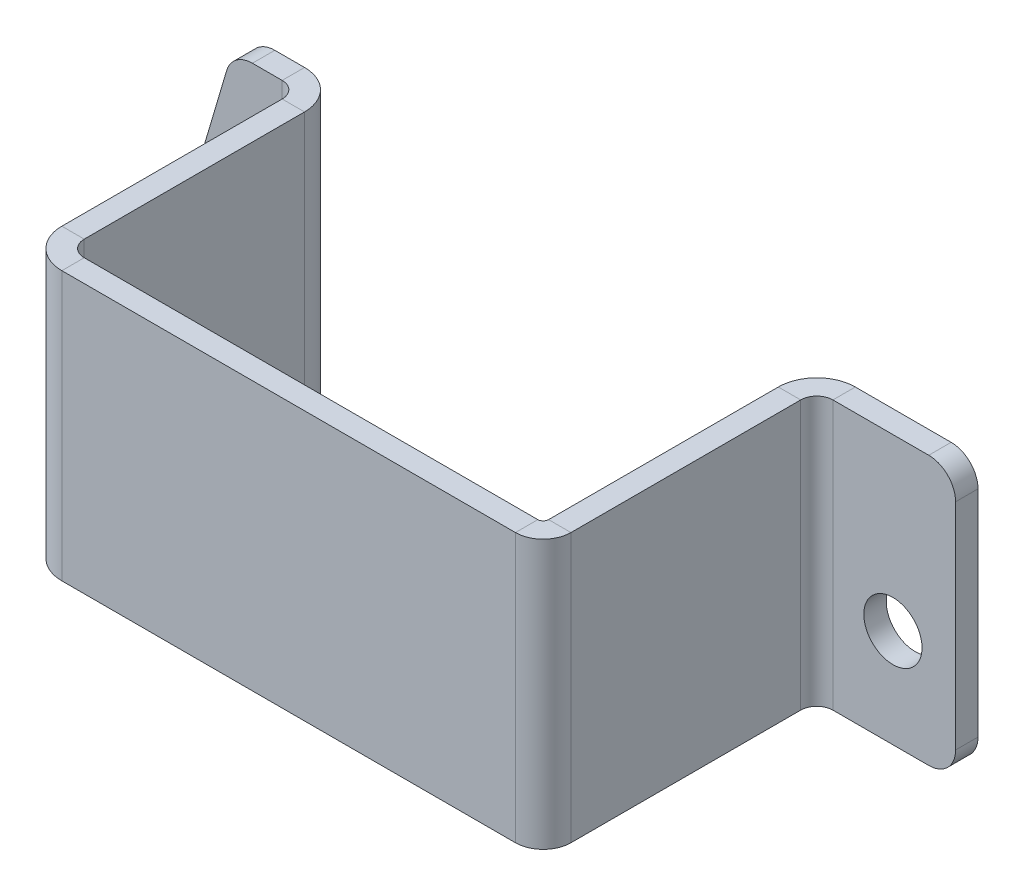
ISO-10303-21;
HEADER;
FILE_DESCRIPTION(('STEP AP214'),'2;1');
FILE_NAME('part.step','',(''),(''),'','','');
FILE_SCHEMA(('AUTOMOTIVE_DESIGN { 1 0 10303 214 1 1 1 1 }'));
ENDSEC;
DATA;
#1=APPLICATION_CONTEXT('core data for automotive mechanical design processes');
#2=APPLICATION_PROTOCOL_DEFINITION('international standard','automotive_design',2000,#1);
#3=PRODUCT_CONTEXT('',#1,'mechanical');
#4=PRODUCT('Part','Part','',(#3));
#5=PRODUCT_RELATED_PRODUCT_CATEGORY('part','',(#4));
#6=PRODUCT_DEFINITION_FORMATION('','',#4);
#7=PRODUCT_DEFINITION_CONTEXT('part definition',#1,'design');
#8=PRODUCT_DEFINITION('design','',#6,#7);
#9=PRODUCT_DEFINITION_SHAPE('','',#8);
#10=(LENGTH_UNIT() NAMED_UNIT(*) SI_UNIT(.MILLI.,.METRE.));
#11=(NAMED_UNIT(*) PLANE_ANGLE_UNIT() SI_UNIT($,.RADIAN.));
#12=(NAMED_UNIT(*) SI_UNIT($,.STERADIAN.) SOLID_ANGLE_UNIT());
#13=UNCERTAINTY_MEASURE_WITH_UNIT(LENGTH_MEASURE(1.E-05),#10,'distance_accuracy_value','');
#14=(GEOMETRIC_REPRESENTATION_CONTEXT(3) GLOBAL_UNCERTAINTY_ASSIGNED_CONTEXT((#13)) GLOBAL_UNIT_ASSIGNED_CONTEXT((#10,
#11,#12)) REPRESENTATION_CONTEXT('',''));
#15=CARTESIAN_POINT('',(0.,0.,0.));
#16=DIRECTION('',(0.,0.,1.));
#17=DIRECTION('',(1.,0.,0.));
#18=AXIS2_PLACEMENT_3D('',#15,#16,#17);
#19=CARTESIAN_POINT('',(177.239805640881,27.,-30.7));
#20=DIRECTION('',(0.,0.,-1.));
#21=DIRECTION('',(-1.,0.,0.));
#22=AXIS2_PLACEMENT_3D('',#19,#20,#21);
#23=PLANE('',#22);
#24=CARTESIAN_POINT('',(37.8398056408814,11.,-30.7));
#25=DIRECTION('',(0.,0.,1.));
#26=DIRECTION('',(1.,0.,0.));
#27=AXIS2_PLACEMENT_3D('',#24,#25,#26);
#28=CIRCLE('',#27,3.25);
#29=CARTESIAN_POINT('',(41.0898056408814,11.,-30.7));
#30=VERTEX_POINT('',#29);
#31=EDGE_CURVE('E300',#30,#30,#28,.T.);
#32=ORIENTED_EDGE('',*,*,#31,.T.);
#33=EDGE_LOOP('',(#32));
#34=FACE_BOUND('',#33,.T.);
#35=DIRECTION('',(-1.,0.,0.));
#36=VECTOR('',#35,1.);
#37=CARTESIAN_POINT('',(41.2192654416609,30.,-30.7));
#38=LINE('',#37,#36);
#39=CARTESIAN_POINT('',(44.5398056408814,30.,-30.7));
#40=VERTEX_POINT('',#39);
#41=CARTESIAN_POINT('',(41.2192654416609,30.,-30.7));
#42=VERTEX_POINT('',#41);
#43=EDGE_CURVE('E306',#40,#42,#38,.T.);
#44=ORIENTED_EDGE('',*,*,#43,.F.);
#45=DIRECTION('',(0.,-1.,0.));
#46=VECTOR('',#45,1.);
#47=CARTESIAN_POINT('',(44.5398056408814,27.,-30.7));
#48=LINE('',#47,#46);
#49=CARTESIAN_POINT('',(44.5398056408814,0.,-30.7));
#50=VERTEX_POINT('',#49);
#51=EDGE_CURVE('E51',#40,#50,#48,.T.);
#52=ORIENTED_EDGE('',*,*,#51,.T.);
#53=DIRECTION('',(1.,0.,0.));
#54=VECTOR('',#53,1.);
#55=CARTESIAN_POINT('',(34.1164713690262,0.,-30.7));
#56=LINE('',#55,#54);
#57=CARTESIAN_POINT('',(34.1164713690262,0.,-30.7));
#58=VERTEX_POINT('',#57);
#59=EDGE_CURVE('E314',#58,#50,#56,.T.);
#60=ORIENTED_EDGE('',*,*,#59,.F.);
#61=CARTESIAN_POINT('',(34.1164713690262,3.,-30.7));
#62=DIRECTION('',(0.,0.,1.));
#63=DIRECTION('',(1.,0.,0.));
#64=AXIS2_PLACEMENT_3D('',#61,#62,#63);
#65=CIRCLE('',#64,3.);
#66=CARTESIAN_POINT('',(31.2398056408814,3.8513485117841,-30.7));
#67=VERTEX_POINT('',#66);
#68=EDGE_CURVE('E312',#67,#58,#65,.T.);
#69=ORIENTED_EDGE('',*,*,#68,.F.);
#70=DIRECTION('',(-0.283782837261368,-0.958888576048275,0.));
#71=VECTOR('',#70,1.);
#72=CARTESIAN_POINT('',(31.2398056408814,3.8513485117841,-30.7));
#73=LINE('',#72,#71);
#74=CARTESIAN_POINT('',(38.3425997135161,27.8513485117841,-30.7));
#75=VERTEX_POINT('',#74);
#76=EDGE_CURVE('E310',#75,#67,#73,.T.);
#77=ORIENTED_EDGE('',*,*,#76,.F.);
#78=CARTESIAN_POINT('',(41.2192654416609,27.,-30.7));
#79=DIRECTION('',(0.,0.,1.));
#80=DIRECTION('',(1.,0.,0.));
#81=AXIS2_PLACEMENT_3D('',#78,#79,#80);
#82=CIRCLE('',#81,3.);
#83=EDGE_CURVE('E308',#42,#75,#82,.T.);
#84=ORIENTED_EDGE('',*,*,#83,.F.);
#85=EDGE_LOOP('',(#44,#52,#60,#69,#77,#84));
#86=FACE_BOUND('',#85,.T.);
#87=ADVANCED_FACE('F30',(#34,#86),#23,.T.);
#88=CARTESIAN_POINT('',(177.239805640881,27.,-28.2));
#89=DIRECTION('',(0.,0.,-1.));
#90=DIRECTION('',(-1.,0.,0.));
#91=AXIS2_PLACEMENT_3D('',#88,#89,#90);
#92=PLANE('',#91);
#93=DIRECTION('',(0.,-1.,0.));
#94=VECTOR('',#93,1.);
#95=CARTESIAN_POINT('',(44.5398056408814,27.,-28.2));
#96=LINE('',#95,#94);
#97=CARTESIAN_POINT('',(44.5398056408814,30.,-28.2));
#98=VERTEX_POINT('',#97);
#99=CARTESIAN_POINT('',(44.5398056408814,0.,-28.2));
#100=VERTEX_POINT('',#99);
#101=EDGE_CURVE('E214',#98,#100,#96,.T.);
#102=ORIENTED_EDGE('',*,*,#101,.F.);
#103=DIRECTION('',(-1.,0.,0.));
#104=VECTOR('',#103,1.);
#105=CARTESIAN_POINT('',(41.2192654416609,30.,-28.2));
#106=LINE('',#105,#104);
#107=CARTESIAN_POINT('',(41.2192654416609,30.,-28.2));
#108=VERTEX_POINT('',#107);
#109=EDGE_CURVE('E316',#98,#108,#106,.T.);
#110=ORIENTED_EDGE('',*,*,#109,.T.);
#111=CARTESIAN_POINT('',(41.2192654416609,27.,-28.2));
#112=DIRECTION('',(0.,0.,1.));
#113=DIRECTION('',(1.,0.,0.));
#114=AXIS2_PLACEMENT_3D('',#111,#112,#113);
#115=CIRCLE('',#114,3.);
#116=CARTESIAN_POINT('',(38.3425997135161,27.8513485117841,-28.2));
#117=VERTEX_POINT('',#116);
#118=EDGE_CURVE('E318',#108,#117,#115,.T.);
#119=ORIENTED_EDGE('',*,*,#118,.T.);
#120=DIRECTION('',(-0.283782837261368,-0.958888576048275,0.));
#121=VECTOR('',#120,1.);
#122=CARTESIAN_POINT('',(31.2398056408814,3.8513485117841,-28.2));
#123=LINE('',#122,#121);
#124=CARTESIAN_POINT('',(31.2398056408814,3.8513485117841,-28.2));
#125=VERTEX_POINT('',#124);
#126=EDGE_CURVE('E320',#117,#125,#123,.T.);
#127=ORIENTED_EDGE('',*,*,#126,.T.);
#128=CARTESIAN_POINT('',(34.1164713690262,3.,-28.2));
#129=DIRECTION('',(0.,0.,1.));
#130=DIRECTION('',(1.,0.,0.));
#131=AXIS2_PLACEMENT_3D('',#128,#129,#130);
#132=CIRCLE('',#131,3.);
#133=CARTESIAN_POINT('',(34.1164713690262,0.,-28.2));
#134=VERTEX_POINT('',#133);
#135=EDGE_CURVE('E322',#125,#134,#132,.T.);
#136=ORIENTED_EDGE('',*,*,#135,.T.);
#137=DIRECTION('',(1.,0.,0.));
#138=VECTOR('',#137,1.);
#139=CARTESIAN_POINT('',(34.1164713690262,0.,-28.2));
#140=LINE('',#139,#138);
#141=EDGE_CURVE('E324',#134,#100,#140,.T.);
#142=ORIENTED_EDGE('',*,*,#141,.T.);
#143=EDGE_LOOP('',(#102,#110,#119,#127,#136,#142));
#144=FACE_BOUND('',#143,.T.);
#145=CARTESIAN_POINT('',(37.8398056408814,11.,-28.2));
#146=DIRECTION('',(0.,0.,1.));
#147=DIRECTION('',(1.,0.,0.));
#148=AXIS2_PLACEMENT_3D('',#145,#146,#147);
#149=CIRCLE('',#148,3.25);
#150=CARTESIAN_POINT('',(41.0898056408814,11.,-28.2));
#151=VERTEX_POINT('',#150);
#152=EDGE_CURVE('E303',#151,#151,#149,.T.);
#153=ORIENTED_EDGE('',*,*,#152,.F.);
#154=EDGE_LOOP('',(#153));
#155=FACE_BOUND('',#154,.T.);
#156=ADVANCED_FACE('F565',(#144,#155),#92,.F.);
#157=CARTESIAN_POINT('',(41.2192654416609,30.,-28.2));
#158=DIRECTION('',(0.,-1.,0.));
#159=DIRECTION('',(1.,0.,0.));
#160=AXIS2_PLACEMENT_3D('',#157,#158,#159);
#161=PLANE('',#160);
#162=DIRECTION('',(0.,0.,1.));
#163=VECTOR('',#162,1.);
#164=CARTESIAN_POINT('',(44.5398056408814,30.,-28.2));
#165=LINE('',#164,#163);
#166=EDGE_CURVE('E38',#40,#98,#165,.T.);
#167=ORIENTED_EDGE('',*,*,#166,.F.);
#168=ORIENTED_EDGE('',*,*,#43,.T.);
#169=DIRECTION('',(0.,0.,-1.));
#170=VECTOR('',#169,1.);
#171=CARTESIAN_POINT('',(41.2192654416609,30.,-28.2));
#172=LINE('',#171,#170);
#173=EDGE_CURVE('E335',#108,#42,#172,.T.);
#174=ORIENTED_EDGE('',*,*,#173,.F.);
#175=ORIENTED_EDGE('',*,*,#109,.F.);
#176=EDGE_LOOP('',(#167,#168,#174,#175));
#177=FACE_BOUND('',#176,.T.);
#178=ADVANCED_FACE('F32',(#177),#161,.F.);
#179=CARTESIAN_POINT('',(34.1164713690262,0.,-28.2));
#180=DIRECTION('',(0.,1.,0.));
#181=DIRECTION('',(0.,0.,1.));
#182=AXIS2_PLACEMENT_3D('',#179,#180,#181);
#183=PLANE('',#182);
#184=DIRECTION('',(0.,0.,-1.));
#185=VECTOR('',#184,1.);
#186=CARTESIAN_POINT('',(44.5398056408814,0.,-28.2));
#187=LINE('',#186,#185);
#188=EDGE_CURVE('E11',#100,#50,#187,.T.);
#189=ORIENTED_EDGE('',*,*,#188,.F.);
#190=ORIENTED_EDGE('',*,*,#141,.F.);
#191=DIRECTION('',(0.,0.,-1.));
#192=VECTOR('',#191,1.);
#193=CARTESIAN_POINT('',(34.1164713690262,0.,-28.2));
#194=LINE('',#193,#192);
#195=EDGE_CURVE('E326',#134,#58,#194,.T.);
#196=ORIENTED_EDGE('',*,*,#195,.T.);
#197=ORIENTED_EDGE('',*,*,#59,.T.);
#198=EDGE_LOOP('',(#189,#190,#196,#197));
#199=FACE_BOUND('',#198,.T.);
#200=ADVANCED_FACE('F575',(#199),#183,.F.);
#201=CARTESIAN_POINT('',(41.2192654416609,27.,-28.2));
#202=DIRECTION('',(0.,0.,-1.));
#203=DIRECTION('',(-1.,0.,0.));
#204=AXIS2_PLACEMENT_3D('',#201,#202,#203);
#205=CYLINDRICAL_SURFACE('',#204,3.);
#206=ORIENTED_EDGE('',*,*,#83,.T.);
#207=DIRECTION('',(0.,0.,-1.));
#208=VECTOR('',#207,1.);
#209=CARTESIAN_POINT('',(38.3425997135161,27.8513485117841,-28.2));
#210=LINE('',#209,#208);
#211=EDGE_CURVE('E332',#117,#75,#210,.T.);
#212=ORIENTED_EDGE('',*,*,#211,.F.);
#213=ORIENTED_EDGE('',*,*,#118,.F.);
#214=ORIENTED_EDGE('',*,*,#173,.T.);
#215=EDGE_LOOP('',(#206,#212,#213,#214));
#216=FACE_BOUND('',#215,.T.);
#217=ADVANCED_FACE('F578',(#216),#205,.T.);
#218=CARTESIAN_POINT('',(31.2398056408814,3.8513485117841,-28.2));
#219=DIRECTION('',(0.958888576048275,-0.283782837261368,0.));
#220=DIRECTION('',(0.283782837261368,0.958888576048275,0.));
#221=AXIS2_PLACEMENT_3D('',#218,#219,#220);
#222=PLANE('',#221);
#223=ORIENTED_EDGE('',*,*,#76,.T.);
#224=DIRECTION('',(0.,0.,-1.));
#225=VECTOR('',#224,1.);
#226=CARTESIAN_POINT('',(31.2398056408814,3.8513485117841,-28.2));
#227=LINE('',#226,#225);
#228=EDGE_CURVE('E329',#125,#67,#227,.T.);
#229=ORIENTED_EDGE('',*,*,#228,.F.);
#230=ORIENTED_EDGE('',*,*,#126,.F.);
#231=ORIENTED_EDGE('',*,*,#211,.T.);
#232=EDGE_LOOP('',(#223,#229,#230,#231));
#233=FACE_BOUND('',#232,.T.);
#234=ADVANCED_FACE('F581',(#233),#222,.F.);
#235=CARTESIAN_POINT('',(34.1164713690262,3.,-28.2));
#236=DIRECTION('',(0.,0.,-1.));
#237=DIRECTION('',(-1.,0.,0.));
#238=AXIS2_PLACEMENT_3D('',#235,#236,#237);
#239=CYLINDRICAL_SURFACE('',#238,3.);
#240=ORIENTED_EDGE('',*,*,#68,.T.);
#241=ORIENTED_EDGE('',*,*,#195,.F.);
#242=ORIENTED_EDGE('',*,*,#135,.F.);
#243=ORIENTED_EDGE('',*,*,#228,.T.);
#244=EDGE_LOOP('',(#240,#241,#242,#243));
#245=FACE_BOUND('',#244,.T.);
#246=ADVANCED_FACE('F561',(#245),#239,.T.);
#247=CARTESIAN_POINT('',(37.8398056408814,11.,-28.2));
#248=DIRECTION('',(0.,0.,-1.));
#249=DIRECTION('',(-1.,0.,0.));
#250=AXIS2_PLACEMENT_3D('',#247,#248,#249);
#251=CYLINDRICAL_SURFACE('',#250,3.25);
#252=ORIENTED_EDGE('',*,*,#152,.T.);
#253=EDGE_LOOP('',(#252));
#254=FACE_BOUND('',#253,.T.);
#255=ORIENTED_EDGE('',*,*,#31,.F.);
#256=EDGE_LOOP('',(#255));
#257=FACE_BOUND('',#256,.T.);
#258=ADVANCED_FACE('F556',(#254,#257),#251,.F.);
#259=CARTESIAN_POINT('',(116.889805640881,27.,-30.5500000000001));
#260=DIRECTION('',(0.,0.,-1.));
#261=DIRECTION('',(-1.,0.,0.));
#262=AXIS2_PLACEMENT_3D('',#259,#260,#261);
#263=PLANE('',#262);
#264=CARTESIAN_POINT('',(112.889805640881,11.,-30.55));
#265=DIRECTION('',(0.,0.,1.));
#266=DIRECTION('',(1.,0.,0.));
#267=AXIS2_PLACEMENT_3D('',#264,#265,#266);
#268=CIRCLE('',#267,3.25000000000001);
#269=CARTESIAN_POINT('',(116.139805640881,11.,-30.55));
#270=VERTEX_POINT('',#269);
#271=EDGE_CURVE('E247',#270,#270,#268,.T.);
#272=ORIENTED_EDGE('',*,*,#271,.T.);
#273=EDGE_LOOP('',(#272));
#274=FACE_BOUND('',#273,.T.);
#275=DIRECTION('',(1.,0.,0.));
#276=VECTOR('',#275,1.);
#277=CARTESIAN_POINT('',(-26.233528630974,0.,-30.55));
#278=LINE('',#277,#276);
#279=CARTESIAN_POINT('',(106.189805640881,0.,-30.55));
#280=VERTEX_POINT('',#279);
#281=CARTESIAN_POINT('',(116.889805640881,0.,-30.55));
#282=VERTEX_POINT('',#281);
#283=EDGE_CURVE('E259',#280,#282,#278,.T.);
#284=ORIENTED_EDGE('',*,*,#283,.F.);
#285=DIRECTION('',(0.,1.,0.));
#286=VECTOR('',#285,1.);
#287=CARTESIAN_POINT('',(106.189805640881,27.,-30.55));
#288=LINE('',#287,#286);
#289=CARTESIAN_POINT('',(106.189805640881,30.,-30.55));
#290=VERTEX_POINT('',#289);
#291=EDGE_CURVE('E289',#280,#290,#288,.T.);
#292=ORIENTED_EDGE('',*,*,#291,.T.);
#293=DIRECTION('',(-1.,0.,0.));
#294=VECTOR('',#293,1.);
#295=CARTESIAN_POINT('',(-19.1307345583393,30.,-30.55));
#296=LINE('',#295,#294);
#297=CARTESIAN_POINT('',(116.889805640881,30.,-30.5500000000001));
#298=VERTEX_POINT('',#297);
#299=EDGE_CURVE('E256',#298,#290,#296,.T.);
#300=ORIENTED_EDGE('',*,*,#299,.F.);
#301=CARTESIAN_POINT('',(116.889805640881,27.,-30.5500000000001));
#302=DIRECTION('',(0.,0.,1.));
#303=DIRECTION('',(-1.,0.,0.));
#304=AXIS2_PLACEMENT_3D('',#301,#302,#303);
#305=CIRCLE('',#304,3.00000000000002);
#306=CARTESIAN_POINT('',(119.889805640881,27.,-30.55));
#307=VERTEX_POINT('',#306);
#308=EDGE_CURVE('E253',#307,#298,#305,.T.);
#309=ORIENTED_EDGE('',*,*,#308,.F.);
#310=DIRECTION('',(0.,1.,0.));
#311=VECTOR('',#310,1.);
#312=CARTESIAN_POINT('',(119.889805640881,3.00000000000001,-30.5500000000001));
#313=LINE('',#312,#311);
#314=CARTESIAN_POINT('',(119.889805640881,3.00000000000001,-30.5500000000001));
#315=VERTEX_POINT('',#314);
#316=EDGE_CURVE('E263',#315,#307,#313,.T.);
#317=ORIENTED_EDGE('',*,*,#316,.F.);
#318=CARTESIAN_POINT('',(116.889805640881,3.00000000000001,-30.55));
#319=DIRECTION('',(0.,0.,1.));
#320=DIRECTION('',(1.,0.,0.));
#321=AXIS2_PLACEMENT_3D('',#318,#319,#320);
#322=CIRCLE('',#321,3.);
#323=EDGE_CURVE('E261',#282,#315,#322,.T.);
#324=ORIENTED_EDGE('',*,*,#323,.F.);
#325=EDGE_LOOP('',(#284,#292,#300,#309,#317,#324));
#326=FACE_BOUND('',#325,.T.);
#327=ADVANCED_FACE('F521',(#274,#326),#263,.T.);
#328=CARTESIAN_POINT('',(116.889805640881,27.,-28.05));
#329=DIRECTION('',(0.,0.,-1.));
#330=DIRECTION('',(-1.,0.,0.));
#331=AXIS2_PLACEMENT_3D('',#328,#329,#330);
#332=PLANE('',#331);
#333=DIRECTION('',(0.,1.,0.));
#334=VECTOR('',#333,1.);
#335=CARTESIAN_POINT('',(106.189805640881,27.,-28.05));
#336=LINE('',#335,#334);
#337=CARTESIAN_POINT('',(106.189805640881,0.,-28.05));
#338=VERTEX_POINT('',#337);
#339=CARTESIAN_POINT('',(106.189805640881,30.,-28.05));
#340=VERTEX_POINT('',#339);
#341=EDGE_CURVE('E291',#338,#340,#336,.T.);
#342=ORIENTED_EDGE('',*,*,#341,.F.);
#343=DIRECTION('',(1.,0.,0.));
#344=VECTOR('',#343,1.);
#345=CARTESIAN_POINT('',(-26.233528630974,0.,-28.05));
#346=LINE('',#345,#344);
#347=CARTESIAN_POINT('',(116.889805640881,0.,-28.05));
#348=VERTEX_POINT('',#347);
#349=EDGE_CURVE('E271',#338,#348,#346,.T.);
#350=ORIENTED_EDGE('',*,*,#349,.T.);
#351=CARTESIAN_POINT('',(116.889805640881,3.00000000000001,-28.05));
#352=DIRECTION('',(0.,0.,1.));
#353=DIRECTION('',(1.,0.,0.));
#354=AXIS2_PLACEMENT_3D('',#351,#352,#353);
#355=CIRCLE('',#354,3.);
#356=CARTESIAN_POINT('',(119.889805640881,3.00000000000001,-28.05));
#357=VERTEX_POINT('',#356);
#358=EDGE_CURVE('E273',#348,#357,#355,.T.);
#359=ORIENTED_EDGE('',*,*,#358,.T.);
#360=DIRECTION('',(0.,1.,0.));
#361=VECTOR('',#360,1.);
#362=CARTESIAN_POINT('',(119.889805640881,3.00000000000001,-28.05));
#363=LINE('',#362,#361);
#364=CARTESIAN_POINT('',(119.889805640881,27.,-28.05));
#365=VERTEX_POINT('',#364);
#366=EDGE_CURVE('E275',#357,#365,#363,.T.);
#367=ORIENTED_EDGE('',*,*,#366,.T.);
#368=CARTESIAN_POINT('',(116.889805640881,27.,-28.05));
#369=DIRECTION('',(0.,0.,1.));
#370=DIRECTION('',(-1.,0.,0.));
#371=AXIS2_PLACEMENT_3D('',#368,#369,#370);
#372=CIRCLE('',#371,3.00000000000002);
#373=CARTESIAN_POINT('',(116.889805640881,30.,-28.05));
#374=VERTEX_POINT('',#373);
#375=EDGE_CURVE('E265',#365,#374,#372,.T.);
#376=ORIENTED_EDGE('',*,*,#375,.T.);
#377=DIRECTION('',(-1.,0.,0.));
#378=VECTOR('',#377,1.);
#379=CARTESIAN_POINT('',(-19.1307345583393,30.,-28.05));
#380=LINE('',#379,#378);
#381=EDGE_CURVE('E268',#374,#340,#380,.T.);
#382=ORIENTED_EDGE('',*,*,#381,.T.);
#383=EDGE_LOOP('',(#342,#350,#359,#367,#376,#382));
#384=FACE_BOUND('',#383,.T.);
#385=CARTESIAN_POINT('',(112.889805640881,11.,-28.05));
#386=DIRECTION('',(0.,0.,1.));
#387=DIRECTION('',(1.,0.,0.));
#388=AXIS2_PLACEMENT_3D('',#385,#386,#387);
#389=CIRCLE('',#388,3.25000000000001);
#390=CARTESIAN_POINT('',(116.139805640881,11.,-28.05));
#391=VERTEX_POINT('',#390);
#392=EDGE_CURVE('E250',#391,#391,#389,.T.);
#393=ORIENTED_EDGE('',*,*,#392,.F.);
#394=EDGE_LOOP('',(#393));
#395=FACE_BOUND('',#394,.T.);
#396=ADVANCED_FACE('F543',(#384,#395),#332,.F.);
#397=CARTESIAN_POINT('',(116.889805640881,27.,-28.05));
#398=DIRECTION('',(0.,0.,-1.));
#399=DIRECTION('',(-1.,0.,0.));
#400=AXIS2_PLACEMENT_3D('',#397,#398,#399);
#401=CYLINDRICAL_SURFACE('',#400,3.00000000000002);
#402=ORIENTED_EDGE('',*,*,#308,.T.);
#403=DIRECTION('',(0.,0.,-1.));
#404=VECTOR('',#403,1.);
#405=CARTESIAN_POINT('',(116.889805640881,30.,-28.05));
#406=LINE('',#405,#404);
#407=EDGE_CURVE('E286',#374,#298,#406,.T.);
#408=ORIENTED_EDGE('',*,*,#407,.F.);
#409=ORIENTED_EDGE('',*,*,#375,.F.);
#410=DIRECTION('',(0.,0.,-1.));
#411=VECTOR('',#410,1.);
#412=CARTESIAN_POINT('',(119.889805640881,27.,-28.05));
#413=LINE('',#412,#411);
#414=EDGE_CURVE('E277',#365,#307,#413,.T.);
#415=ORIENTED_EDGE('',*,*,#414,.T.);
#416=EDGE_LOOP('',(#402,#408,#409,#415));
#417=FACE_BOUND('',#416,.T.);
#418=ADVANCED_FACE('F529',(#417),#401,.T.);
#419=CARTESIAN_POINT('',(-19.1307345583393,30.,-28.05));
#420=DIRECTION('',(0.,-1.,0.));
#421=DIRECTION('',(1.,0.,0.));
#422=AXIS2_PLACEMENT_3D('',#419,#420,#421);
#423=PLANE('',#422);
#424=DIRECTION('',(0.,0.,-1.));
#425=VECTOR('',#424,1.);
#426=CARTESIAN_POINT('',(106.189805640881,30.,-28.05));
#427=LINE('',#426,#425);
#428=EDGE_CURVE('E294',#340,#290,#427,.T.);
#429=ORIENTED_EDGE('',*,*,#428,.F.);
#430=ORIENTED_EDGE('',*,*,#381,.F.);
#431=ORIENTED_EDGE('',*,*,#407,.T.);
#432=ORIENTED_EDGE('',*,*,#299,.T.);
#433=EDGE_LOOP('',(#429,#430,#431,#432));
#434=FACE_BOUND('',#433,.T.);
#435=ADVANCED_FACE('F525',(#434),#423,.F.);
#436=CARTESIAN_POINT('',(-26.233528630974,0.,-28.05));
#437=DIRECTION('',(0.,1.,0.));
#438=DIRECTION('',(0.,0.,1.));
#439=AXIS2_PLACEMENT_3D('',#436,#437,#438);
#440=PLANE('',#439);
#441=DIRECTION('',(0.,0.,1.));
#442=VECTOR('',#441,1.);
#443=CARTESIAN_POINT('',(106.189805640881,0.,-28.05));
#444=LINE('',#443,#442);
#445=EDGE_CURVE('E297',#280,#338,#444,.T.);
#446=ORIENTED_EDGE('',*,*,#445,.F.);
#447=ORIENTED_EDGE('',*,*,#283,.T.);
#448=DIRECTION('',(0.,0.,-1.));
#449=VECTOR('',#448,1.);
#450=CARTESIAN_POINT('',(116.889805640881,0.,-28.05));
#451=LINE('',#450,#449);
#452=EDGE_CURVE('E283',#348,#282,#451,.T.);
#453=ORIENTED_EDGE('',*,*,#452,.F.);
#454=ORIENTED_EDGE('',*,*,#349,.F.);
#455=EDGE_LOOP('',(#446,#447,#453,#454));
#456=FACE_BOUND('',#455,.T.);
#457=ADVANCED_FACE('F541',(#456),#440,.F.);
#458=CARTESIAN_POINT('',(116.889805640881,3.00000000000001,-28.05));
#459=DIRECTION('',(0.,0.,-1.));
#460=DIRECTION('',(-1.,0.,0.));
#461=AXIS2_PLACEMENT_3D('',#458,#459,#460);
#462=CYLINDRICAL_SURFACE('',#461,3.);
#463=ORIENTED_EDGE('',*,*,#323,.T.);
#464=DIRECTION('',(0.,0.,-1.));
#465=VECTOR('',#464,1.);
#466=CARTESIAN_POINT('',(119.889805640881,3.00000000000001,-28.05));
#467=LINE('',#466,#465);
#468=EDGE_CURVE('E280',#357,#315,#467,.T.);
#469=ORIENTED_EDGE('',*,*,#468,.F.);
#470=ORIENTED_EDGE('',*,*,#358,.F.);
#471=ORIENTED_EDGE('',*,*,#452,.T.);
#472=EDGE_LOOP('',(#463,#469,#470,#471));
#473=FACE_BOUND('',#472,.T.);
#474=ADVANCED_FACE('F538',(#473),#462,.T.);
#475=CARTESIAN_POINT('',(119.889805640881,3.00000000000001,-28.05));
#476=DIRECTION('',(-1.,0.,0.));
#477=DIRECTION('',(0.,-1.,0.));
#478=AXIS2_PLACEMENT_3D('',#475,#476,#477);
#479=PLANE('',#478);
#480=ORIENTED_EDGE('',*,*,#316,.T.);
#481=ORIENTED_EDGE('',*,*,#414,.F.);
#482=ORIENTED_EDGE('',*,*,#366,.F.);
#483=ORIENTED_EDGE('',*,*,#468,.T.);
#484=EDGE_LOOP('',(#480,#481,#482,#483));
#485=FACE_BOUND('',#484,.T.);
#486=ADVANCED_FACE('F533',(#485),#479,.F.);
#487=CARTESIAN_POINT('',(112.889805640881,11.,-28.05));
#488=DIRECTION('',(0.,0.,-1.));
#489=DIRECTION('',(-1.,0.,0.));
#490=AXIS2_PLACEMENT_3D('',#487,#488,#489);
#491=CYLINDRICAL_SURFACE('',#490,3.25000000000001);
#492=ORIENTED_EDGE('',*,*,#392,.T.);
#493=EDGE_LOOP('',(#492));
#494=FACE_BOUND('',#493,.T.);
#495=ORIENTED_EDGE('',*,*,#271,.F.);
#496=EDGE_LOOP('',(#495));
#497=FACE_BOUND('',#496,.T.);
#498=ADVANCED_FACE('F549',(#494,#497),#491,.F.);
#499=CARTESIAN_POINT('',(46.3398056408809,27.,100.5));
#500=DIRECTION('',(1.,0.,0.));
#501=DIRECTION('',(0.,0.,-1.));
#502=AXIS2_PLACEMENT_3D('',#499,#500,#501);
#503=PLANE('',#502);
#504=DIRECTION('',(0.,0.,-1.));
#505=VECTOR('',#504,1.);
#506=CARTESIAN_POINT('',(46.3398056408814,30.,-35.5205401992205));
#507=LINE('',#506,#505);
#508=CARTESIAN_POINT('',(46.3398056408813,30.,-1.80000000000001));
#509=VERTEX_POINT('',#508);
#510=CARTESIAN_POINT('',(46.3398056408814,30.,-26.4));
#511=VERTEX_POINT('',#510);
#512=EDGE_CURVE('E224',#509,#511,#507,.T.);
#513=ORIENTED_EDGE('',*,*,#512,.T.);
#514=DIRECTION('',(0.,-1.,0.));
#515=VECTOR('',#514,1.);
#516=CARTESIAN_POINT('',(46.3398056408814,27.,-26.4));
#517=LINE('',#516,#515);
#518=CARTESIAN_POINT('',(46.3398056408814,0.,-26.4));
#519=VERTEX_POINT('',#518);
#520=EDGE_CURVE('E211',#511,#519,#517,.T.);
#521=ORIENTED_EDGE('',*,*,#520,.T.);
#522=DIRECTION('',(0.,0.,1.));
#523=VECTOR('',#522,1.);
#524=CARTESIAN_POINT('',(46.3398056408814,0.,-42.6233342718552));
#525=LINE('',#524,#523);
#526=CARTESIAN_POINT('',(46.3398056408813,0.,-1.80000000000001));
#527=VERTEX_POINT('',#526);
#528=EDGE_CURVE('E221',#519,#527,#525,.T.);
#529=ORIENTED_EDGE('',*,*,#528,.T.);
#530=DIRECTION('',(0.,-1.,0.));
#531=VECTOR('',#530,1.);
#532=CARTESIAN_POINT('',(46.3398056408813,27.,-1.80000000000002));
#533=LINE('',#532,#531);
#534=EDGE_CURVE('E231',#509,#527,#533,.T.);
#535=ORIENTED_EDGE('',*,*,#534,.F.);
#536=EDGE_LOOP('',(#513,#521,#529,#535));
#537=FACE_BOUND('',#536,.T.);
#538=ADVANCED_FACE('F220',(#537),#503,.F.);
#539=CARTESIAN_POINT('',(46.3398056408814,30.,-35.5205401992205));
#540=DIRECTION('',(0.,-1.,0.));
#541=DIRECTION('',(0.,0.,1.));
#542=AXIS2_PLACEMENT_3D('',#539,#540,#541);
#543=PLANE('',#542);
#544=DIRECTION('',(0.,0.,-1.));
#545=VECTOR('',#544,1.);
#546=CARTESIAN_POINT('',(48.8398056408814,30.,-35.5205401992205));
#547=LINE('',#546,#545);
#548=CARTESIAN_POINT('',(48.8398056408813,30.,-1.80000000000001));
#549=VERTEX_POINT('',#548);
#550=CARTESIAN_POINT('',(48.8398056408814,30.,-26.4));
#551=VERTEX_POINT('',#550);
#552=EDGE_CURVE('E452',#549,#551,#547,.T.);
#553=ORIENTED_EDGE('',*,*,#552,.T.);
#554=DIRECTION('',(-1.,0.,0.));
#555=VECTOR('',#554,1.);
#556=CARTESIAN_POINT('',(46.3398056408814,30.,-26.4));
#557=LINE('',#556,#555);
#558=EDGE_CURVE('E203',#551,#511,#557,.T.);
#559=ORIENTED_EDGE('',*,*,#558,.T.);
#560=ORIENTED_EDGE('',*,*,#512,.F.);
#561=DIRECTION('',(-1.,0.,0.));
#562=VECTOR('',#561,1.);
#563=CARTESIAN_POINT('',(46.3398056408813,30.,-1.80000000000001));
#564=LINE('',#563,#562);
#565=EDGE_CURVE('E234',#549,#509,#564,.T.);
#566=ORIENTED_EDGE('',*,*,#565,.F.);
#567=EDGE_LOOP('',(#553,#559,#560,#566));
#568=FACE_BOUND('',#567,.T.);
#569=ADVANCED_FACE('F696',(#568),#543,.F.);
#570=CARTESIAN_POINT('',(46.3398056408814,0.,-42.6233342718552));
#571=DIRECTION('',(0.,1.,0.));
#572=DIRECTION('',(-1.,0.,0.));
#573=AXIS2_PLACEMENT_3D('',#570,#571,#572);
#574=PLANE('',#573);
#575=ORIENTED_EDGE('',*,*,#528,.F.);
#576=DIRECTION('',(1.,0.,0.));
#577=VECTOR('',#576,1.);
#578=CARTESIAN_POINT('',(46.3398056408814,0.,-26.4));
#579=LINE('',#578,#577);
#580=CARTESIAN_POINT('',(48.8398056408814,0.,-26.4));
#581=VERTEX_POINT('',#580);
#582=EDGE_CURVE('E192',#519,#581,#579,.T.);
#583=ORIENTED_EDGE('',*,*,#582,.T.);
#584=DIRECTION('',(0.,0.,1.));
#585=VECTOR('',#584,1.);
#586=CARTESIAN_POINT('',(48.8398056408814,0.,-42.6233342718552));
#587=LINE('',#586,#585);
#588=CARTESIAN_POINT('',(48.8398056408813,0.,-1.80000000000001));
#589=VERTEX_POINT('',#588);
#590=EDGE_CURVE('E236',#581,#589,#587,.T.);
#591=ORIENTED_EDGE('',*,*,#590,.T.);
#592=DIRECTION('',(1.,0.,0.));
#593=VECTOR('',#592,1.);
#594=CARTESIAN_POINT('',(46.3398056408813,0.,-1.80000000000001));
#595=LINE('',#594,#593);
#596=EDGE_CURVE('E229',#527,#589,#595,.T.);
#597=ORIENTED_EDGE('',*,*,#596,.F.);
#598=EDGE_LOOP('',(#575,#583,#591,#597));
#599=FACE_BOUND('',#598,.T.);
#600=ADVANCED_FACE('F227',(#599),#574,.F.);
#601=CARTESIAN_POINT('',(48.8398056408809,27.,100.5));
#602=DIRECTION('',(1.,0.,0.));
#603=DIRECTION('',(0.,0.,-1.));
#604=AXIS2_PLACEMENT_3D('',#601,#602,#603);
#605=PLANE('',#604);
#606=DIRECTION('',(0.,-1.,0.));
#607=VECTOR('',#606,1.);
#608=CARTESIAN_POINT('',(48.8398056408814,27.,-26.4));
#609=LINE('',#608,#607);
#610=EDGE_CURVE('E225',#551,#581,#609,.T.);
#611=ORIENTED_EDGE('',*,*,#610,.F.);
#612=ORIENTED_EDGE('',*,*,#552,.F.);
#613=DIRECTION('',(0.,-1.,0.));
#614=VECTOR('',#613,1.);
#615=CARTESIAN_POINT('',(48.8398056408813,27.,-1.80000000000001));
#616=LINE('',#615,#614);
#617=EDGE_CURVE('E204',#549,#589,#616,.T.);
#618=ORIENTED_EDGE('',*,*,#617,.T.);
#619=ORIENTED_EDGE('',*,*,#590,.F.);
#620=EDGE_LOOP('',(#611,#612,#618,#619));
#621=FACE_BOUND('',#620,.T.);
#622=ADVANCED_FACE('F714',(#621),#605,.T.);
#623=CARTESIAN_POINT('',(104.389805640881,27.,-42.75));
#624=DIRECTION('',(-1.,0.,0.));
#625=DIRECTION('',(0.,0.,1.));
#626=AXIS2_PLACEMENT_3D('',#623,#624,#625);
#627=PLANE('',#626);
#628=DIRECTION('',(0.,0.,-1.));
#629=VECTOR('',#628,1.);
#630=CARTESIAN_POINT('',(104.389805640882,0.,100.373334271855));
#631=LINE('',#630,#629);
#632=CARTESIAN_POINT('',(104.389805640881,0.,-0.600000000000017));
#633=VERTEX_POINT('',#632);
#634=CARTESIAN_POINT('',(104.389805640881,0.,-26.25));
#635=VERTEX_POINT('',#634);
#636=EDGE_CURVE('E426',#633,#635,#631,.T.);
#637=ORIENTED_EDGE('',*,*,#636,.T.);
#638=DIRECTION('',(0.,1.,0.));
#639=VECTOR('',#638,1.);
#640=CARTESIAN_POINT('',(104.389805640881,27.,-26.25));
#641=LINE('',#640,#639);
#642=CARTESIAN_POINT('',(104.389805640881,30.,-26.25));
#643=VERTEX_POINT('',#642);
#644=EDGE_CURVE('E446',#635,#643,#641,.T.);
#645=ORIENTED_EDGE('',*,*,#644,.T.);
#646=DIRECTION('',(0.,0.,1.));
#647=VECTOR('',#646,1.);
#648=CARTESIAN_POINT('',(104.389805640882,30.,93.2705401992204));
#649=LINE('',#648,#647);
#650=CARTESIAN_POINT('',(104.389805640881,30.,-0.600000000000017));
#651=VERTEX_POINT('',#650);
#652=EDGE_CURVE('E424',#643,#651,#649,.T.);
#653=ORIENTED_EDGE('',*,*,#652,.T.);
#654=DIRECTION('',(0.,1.,0.));
#655=VECTOR('',#654,1.);
#656=CARTESIAN_POINT('',(104.389805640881,27.,-0.600000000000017));
#657=LINE('',#656,#655);
#658=EDGE_CURVE('E429',#633,#651,#657,.T.);
#659=ORIENTED_EDGE('',*,*,#658,.F.);
#660=EDGE_LOOP('',(#637,#645,#653,#659));
#661=FACE_BOUND('',#660,.T.);
#662=ADVANCED_FACE('F509',(#661),#627,.F.);
#663=CARTESIAN_POINT('',(104.389805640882,30.,93.2705401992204));
#664=DIRECTION('',(0.,-1.,0.));
#665=DIRECTION('',(0.,0.,-1.));
#666=AXIS2_PLACEMENT_3D('',#663,#664,#665);
#667=PLANE('',#666);
#668=ORIENTED_EDGE('',*,*,#652,.F.);
#669=DIRECTION('',(-1.,0.,0.));
#670=VECTOR('',#669,1.);
#671=CARTESIAN_POINT('',(104.389805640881,30.,-26.25));
#672=LINE('',#671,#670);
#673=CARTESIAN_POINT('',(101.889805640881,30.,-26.25));
#674=VERTEX_POINT('',#673);
#675=EDGE_CURVE('E443',#643,#674,#672,.T.);
#676=ORIENTED_EDGE('',*,*,#675,.T.);
#677=DIRECTION('',(0.,0.,1.));
#678=VECTOR('',#677,1.);
#679=CARTESIAN_POINT('',(101.889805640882,30.,93.2705401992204));
#680=LINE('',#679,#678);
#681=CARTESIAN_POINT('',(101.889805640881,30.,-0.600000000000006));
#682=VERTEX_POINT('',#681);
#683=EDGE_CURVE('E418',#674,#682,#680,.T.);
#684=ORIENTED_EDGE('',*,*,#683,.T.);
#685=DIRECTION('',(-1.,0.,0.));
#686=VECTOR('',#685,1.);
#687=CARTESIAN_POINT('',(104.389805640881,30.,-0.600000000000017));
#688=LINE('',#687,#686);
#689=EDGE_CURVE('E434',#651,#682,#688,.T.);
#690=ORIENTED_EDGE('',*,*,#689,.F.);
#691=EDGE_LOOP('',(#668,#676,#684,#690));
#692=FACE_BOUND('',#691,.T.);
#693=ADVANCED_FACE('F499',(#692),#667,.F.);
#694=CARTESIAN_POINT('',(104.389805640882,0.,100.373334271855));
#695=DIRECTION('',(0.,1.,0.));
#696=DIRECTION('',(1.,0.,0.));
#697=AXIS2_PLACEMENT_3D('',#694,#695,#696);
#698=PLANE('',#697);
#699=DIRECTION('',(0.,0.,-1.));
#700=VECTOR('',#699,1.);
#701=CARTESIAN_POINT('',(101.889805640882,0.,100.373334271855));
#702=LINE('',#701,#700);
#703=CARTESIAN_POINT('',(101.889805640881,0.,-0.600000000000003));
#704=VERTEX_POINT('',#703);
#705=CARTESIAN_POINT('',(101.889805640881,0.,-26.25));
#706=VERTEX_POINT('',#705);
#707=EDGE_CURVE('E421',#704,#706,#702,.T.);
#708=ORIENTED_EDGE('',*,*,#707,.T.);
#709=DIRECTION('',(1.,0.,0.));
#710=VECTOR('',#709,1.);
#711=CARTESIAN_POINT('',(104.389805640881,0.,-26.25));
#712=LINE('',#711,#710);
#713=EDGE_CURVE('E440',#706,#635,#712,.T.);
#714=ORIENTED_EDGE('',*,*,#713,.T.);
#715=ORIENTED_EDGE('',*,*,#636,.F.);
#716=DIRECTION('',(1.,0.,0.));
#717=VECTOR('',#716,1.);
#718=CARTESIAN_POINT('',(104.389805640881,0.,-0.600000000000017));
#719=LINE('',#718,#717);
#720=EDGE_CURVE('E437',#704,#633,#719,.T.);
#721=ORIENTED_EDGE('',*,*,#720,.F.);
#722=EDGE_LOOP('',(#708,#714,#715,#721));
#723=FACE_BOUND('',#722,.T.);
#724=ADVANCED_FACE('F512',(#723),#698,.F.);
#725=CARTESIAN_POINT('',(101.889805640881,27.,-42.75));
#726=DIRECTION('',(-1.,0.,0.));
#727=DIRECTION('',(0.,0.,1.));
#728=AXIS2_PLACEMENT_3D('',#725,#726,#727);
#729=PLANE('',#728);
#730=DIRECTION('',(0.,1.,0.));
#731=VECTOR('',#730,1.);
#732=CARTESIAN_POINT('',(101.889805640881,27.,-26.25));
#733=LINE('',#732,#731);
#734=EDGE_CURVE('E449',#706,#674,#733,.T.);
#735=ORIENTED_EDGE('',*,*,#734,.F.);
#736=ORIENTED_EDGE('',*,*,#707,.F.);
#737=DIRECTION('',(0.,1.,0.));
#738=VECTOR('',#737,1.);
#739=CARTESIAN_POINT('',(101.889805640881,27.,-0.600000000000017));
#740=LINE('',#739,#738);
#741=EDGE_CURVE('E432',#704,#682,#740,.T.);
#742=ORIENTED_EDGE('',*,*,#741,.T.);
#743=ORIENTED_EDGE('',*,*,#683,.F.);
#744=EDGE_LOOP('',(#735,#736,#742,#743));
#745=FACE_BOUND('',#744,.T.);
#746=ADVANCED_FACE('F495',(#745),#729,.T.);
#747=CARTESIAN_POINT('',(147.139805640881,27.,2.5));
#748=DIRECTION('',(0.,0.,-1.));
#749=DIRECTION('',(-1.,0.,0.));
#750=AXIS2_PLACEMENT_3D('',#747,#748,#749);
#751=PLANE('',#750);
#752=DIRECTION('',(-1.,0.,0.));
#753=VECTOR('',#752,1.);
#754=CARTESIAN_POINT('',(11.1192654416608,30.,2.5));
#755=LINE('',#754,#753);
#756=CARTESIAN_POINT('',(101.289805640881,30.,2.49999999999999));
#757=VERTEX_POINT('',#756);
#758=CARTESIAN_POINT('',(50.6398056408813,30.,2.5));
#759=VERTEX_POINT('',#758);
#760=EDGE_CURVE('E390',#757,#759,#755,.T.);
#761=ORIENTED_EDGE('',*,*,#760,.T.);
#762=DIRECTION('',(0.,-1.,0.));
#763=VECTOR('',#762,1.);
#764=CARTESIAN_POINT('',(50.6398056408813,27.,2.5));
#765=LINE('',#764,#763);
#766=CARTESIAN_POINT('',(50.6398056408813,0.,2.5));
#767=VERTEX_POINT('',#766);
#768=EDGE_CURVE('E413',#759,#767,#765,.T.);
#769=ORIENTED_EDGE('',*,*,#768,.T.);
#770=DIRECTION('',(1.,0.,0.));
#771=VECTOR('',#770,1.);
#772=CARTESIAN_POINT('',(4.0164713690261,0.,2.5));
#773=LINE('',#772,#771);
#774=CARTESIAN_POINT('',(101.289805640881,0.,2.5));
#775=VERTEX_POINT('',#774);
#776=EDGE_CURVE('E393',#767,#775,#773,.T.);
#777=ORIENTED_EDGE('',*,*,#776,.T.);
#778=DIRECTION('',(0.,1.,0.));
#779=VECTOR('',#778,1.);
#780=CARTESIAN_POINT('',(101.289805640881,27.,2.5));
#781=LINE('',#780,#779);
#782=EDGE_CURVE('E402',#775,#757,#781,.T.);
#783=ORIENTED_EDGE('',*,*,#782,.T.);
#784=EDGE_LOOP('',(#761,#769,#777,#783));
#785=FACE_BOUND('',#784,.T.);
#786=ADVANCED_FACE('F480',(#785),#751,.F.);
#787=CARTESIAN_POINT('',(11.1192654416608,30.,2.5));
#788=DIRECTION('',(0.,-1.,0.));
#789=DIRECTION('',(1.,0.,0.));
#790=AXIS2_PLACEMENT_3D('',#787,#788,#789);
#791=PLANE('',#790);
#792=DIRECTION('',(-1.,0.,0.));
#793=VECTOR('',#792,1.);
#794=CARTESIAN_POINT('',(11.1192654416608,30.,0.));
#795=LINE('',#794,#793);
#796=CARTESIAN_POINT('',(101.289805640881,30.,0.));
#797=VERTEX_POINT('',#796);
#798=CARTESIAN_POINT('',(50.6398056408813,30.,0.));
#799=VERTEX_POINT('',#798);
#800=EDGE_CURVE('E384',#797,#799,#795,.T.);
#801=ORIENTED_EDGE('',*,*,#800,.T.);
#802=DIRECTION('',(0.,0.,1.));
#803=VECTOR('',#802,1.);
#804=CARTESIAN_POINT('',(50.6398056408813,30.,2.5));
#805=LINE('',#804,#803);
#806=EDGE_CURVE('E410',#799,#759,#805,.T.);
#807=ORIENTED_EDGE('',*,*,#806,.T.);
#808=ORIENTED_EDGE('',*,*,#760,.F.);
#809=DIRECTION('',(0.,0.,-1.));
#810=VECTOR('',#809,1.);
#811=CARTESIAN_POINT('',(101.289805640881,30.,2.5));
#812=LINE('',#811,#810);
#813=EDGE_CURVE('E399',#757,#797,#812,.T.);
#814=ORIENTED_EDGE('',*,*,#813,.T.);
#815=EDGE_LOOP('',(#801,#807,#808,#814));
#816=FACE_BOUND('',#815,.T.);
#817=ADVANCED_FACE('F470',(#816),#791,.F.);
#818=CARTESIAN_POINT('',(4.0164713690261,0.,2.5));
#819=DIRECTION('',(0.,1.,0.));
#820=DIRECTION('',(0.,0.,1.));
#821=AXIS2_PLACEMENT_3D('',#818,#819,#820);
#822=PLANE('',#821);
#823=ORIENTED_EDGE('',*,*,#776,.F.);
#824=DIRECTION('',(0.,0.,-1.));
#825=VECTOR('',#824,1.);
#826=CARTESIAN_POINT('',(50.6398056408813,0.,2.5));
#827=LINE('',#826,#825);
#828=CARTESIAN_POINT('',(50.6398056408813,0.,0.));
#829=VERTEX_POINT('',#828);
#830=EDGE_CURVE('E407',#767,#829,#827,.T.);
#831=ORIENTED_EDGE('',*,*,#830,.T.);
#832=DIRECTION('',(1.,0.,0.));
#833=VECTOR('',#832,1.);
#834=CARTESIAN_POINT('',(4.0164713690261,0.,0.));
#835=LINE('',#834,#833);
#836=CARTESIAN_POINT('',(101.289805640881,0.,0.));
#837=VERTEX_POINT('',#836);
#838=EDGE_CURVE('E387',#829,#837,#835,.T.);
#839=ORIENTED_EDGE('',*,*,#838,.T.);
#840=DIRECTION('',(0.,0.,1.));
#841=VECTOR('',#840,1.);
#842=CARTESIAN_POINT('',(101.289805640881,0.,2.5));
#843=LINE('',#842,#841);
#844=EDGE_CURVE('E396',#837,#775,#843,.T.);
#845=ORIENTED_EDGE('',*,*,#844,.T.);
#846=EDGE_LOOP('',(#823,#831,#839,#845));
#847=FACE_BOUND('',#846,.T.);
#848=ADVANCED_FACE('F484',(#847),#822,.F.);
#849=CARTESIAN_POINT('',(147.139805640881,27.,0.));
#850=DIRECTION('',(0.,0.,-1.));
#851=DIRECTION('',(-1.,0.,0.));
#852=AXIS2_PLACEMENT_3D('',#849,#850,#851);
#853=PLANE('',#852);
#854=DIRECTION('',(0.,-1.,0.));
#855=VECTOR('',#854,1.);
#856=CARTESIAN_POINT('',(50.6398056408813,27.,0.));
#857=LINE('',#856,#855);
#858=EDGE_CURVE('E416',#799,#829,#857,.T.);
#859=ORIENTED_EDGE('',*,*,#858,.F.);
#860=ORIENTED_EDGE('',*,*,#800,.F.);
#861=DIRECTION('',(0.,1.,0.));
#862=VECTOR('',#861,1.);
#863=CARTESIAN_POINT('',(101.289805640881,27.,0.));
#864=LINE('',#863,#862);
#865=EDGE_CURVE('E405',#837,#797,#864,.T.);
#866=ORIENTED_EDGE('',*,*,#865,.F.);
#867=ORIENTED_EDGE('',*,*,#838,.F.);
#868=EDGE_LOOP('',(#859,#860,#866,#867));
#869=FACE_BOUND('',#868,.T.);
#870=ADVANCED_FACE('F467',(#869),#853,.T.);
#871=CARTESIAN_POINT('',(101.289805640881,30.,-0.6));
#872=DIRECTION('',(0.,1.,0.));
#873=DIRECTION('',(0.,0.,1.));
#874=AXIS2_PLACEMENT_3D('',#871,#872,#873);
#875=PLANE('',#874);
#876=ORIENTED_EDGE('',*,*,#689,.T.);
#877=CARTESIAN_POINT('',(101.289805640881,30.,-0.6));
#878=DIRECTION('',(0.,-1.,0.));
#879=DIRECTION('',(1.,0.,0.));
#880=AXIS2_PLACEMENT_3D('',#877,#878,#879);
#881=CIRCLE('',#880,0.599999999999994);
#882=EDGE_CURVE('E375',#682,#797,#881,.T.);
#883=ORIENTED_EDGE('',*,*,#882,.T.);
#884=ORIENTED_EDGE('',*,*,#813,.F.);
#885=CARTESIAN_POINT('',(101.289805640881,30.,-0.6));
#886=DIRECTION('',(0.,-1.,0.));
#887=DIRECTION('',(1.,0.,0.));
#888=AXIS2_PLACEMENT_3D('',#885,#886,#887);
#889=CIRCLE('',#888,3.09999999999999);
#890=EDGE_CURVE('E381',#651,#757,#889,.T.);
#891=ORIENTED_EDGE('',*,*,#890,.F.);
#892=EDGE_LOOP('',(#876,#883,#884,#891));
#893=FACE_BOUND('',#892,.T.);
#894=ADVANCED_FACE('F474',(#893),#875,.T.);
#895=CARTESIAN_POINT('',(101.289805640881,0.,-0.6));
#896=DIRECTION('',(0.,-1.,0.));
#897=DIRECTION('',(0.,0.,-1.));
#898=AXIS2_PLACEMENT_3D('',#895,#896,#897);
#899=PLANE('',#898);
#900=ORIENTED_EDGE('',*,*,#844,.F.);
#901=CARTESIAN_POINT('',(101.289805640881,0.,-0.6));
#902=DIRECTION('',(0.,-1.,0.));
#903=DIRECTION('',(1.,0.,0.));
#904=AXIS2_PLACEMENT_3D('',#901,#902,#903);
#905=CIRCLE('',#904,0.599999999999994);
#906=EDGE_CURVE('E372',#837,#704,#905,.F.);
#907=ORIENTED_EDGE('',*,*,#906,.T.);
#908=ORIENTED_EDGE('',*,*,#720,.T.);
#909=CARTESIAN_POINT('',(101.289805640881,0.,-0.6));
#910=DIRECTION('',(0.,-1.,0.));
#911=DIRECTION('',(1.,0.,0.));
#912=AXIS2_PLACEMENT_3D('',#909,#910,#911);
#913=CIRCLE('',#912,3.09999999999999);
#914=EDGE_CURVE('E378',#775,#633,#913,.F.);
#915=ORIENTED_EDGE('',*,*,#914,.F.);
#916=EDGE_LOOP('',(#900,#907,#908,#915));
#917=FACE_BOUND('',#916,.T.);
#918=ADVANCED_FACE('F487',(#917),#899,.T.);
#919=CARTESIAN_POINT('',(101.289805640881,214.754419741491,-0.6));
#920=DIRECTION('',(0.,-1.,0.));
#921=DIRECTION('',(1.,0.,0.));
#922=AXIS2_PLACEMENT_3D('',#919,#920,#921);
#923=CYLINDRICAL_SURFACE('',#922,3.09999999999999);
#924=ORIENTED_EDGE('',*,*,#914,.T.);
#925=ORIENTED_EDGE('',*,*,#658,.T.);
#926=ORIENTED_EDGE('',*,*,#890,.T.);
#927=ORIENTED_EDGE('',*,*,#782,.F.);
#928=EDGE_LOOP('',(#924,#925,#926,#927));
#929=FACE_BOUND('',#928,.T.);
#930=ADVANCED_FACE('F478',(#929),#923,.T.);
#931=CARTESIAN_POINT('',(101.289805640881,214.754419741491,-0.6));
#932=DIRECTION('',(0.,-1.,0.));
#933=DIRECTION('',(1.,0.,0.));
#934=AXIS2_PLACEMENT_3D('',#931,#932,#933);
#935=CYLINDRICAL_SURFACE('',#934,0.599999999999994);
#936=ORIENTED_EDGE('',*,*,#906,.F.);
#937=ORIENTED_EDGE('',*,*,#865,.T.);
#938=ORIENTED_EDGE('',*,*,#882,.F.);
#939=ORIENTED_EDGE('',*,*,#741,.F.);
#940=EDGE_LOOP('',(#936,#937,#938,#939));
#941=FACE_BOUND('',#940,.T.);
#942=ADVANCED_FACE('F490',(#941),#935,.F.);
#943=CARTESIAN_POINT('',(50.6398056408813,0.,-1.8));
#944=DIRECTION('',(0.,-1.,0.));
#945=DIRECTION('',(0.,0.,-1.));
#946=AXIS2_PLACEMENT_3D('',#943,#944,#945);
#947=PLANE('',#946);
#948=ORIENTED_EDGE('',*,*,#596,.T.);
#949=CARTESIAN_POINT('',(50.6398056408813,0.,-1.8));
#950=DIRECTION('',(0.,1.,0.));
#951=DIRECTION('',(-1.,0.,0.));
#952=AXIS2_PLACEMENT_3D('',#949,#950,#951);
#953=CIRCLE('',#952,1.8);
#954=EDGE_CURVE('E363',#589,#829,#953,.T.);
#955=ORIENTED_EDGE('',*,*,#954,.T.);
#956=ORIENTED_EDGE('',*,*,#830,.F.);
#957=CARTESIAN_POINT('',(50.6398056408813,0.,-1.8));
#958=DIRECTION('',(0.,1.,0.));
#959=DIRECTION('',(-1.,0.,0.));
#960=AXIS2_PLACEMENT_3D('',#957,#958,#959);
#961=CIRCLE('',#960,4.3);
#962=EDGE_CURVE('E369',#527,#767,#961,.T.);
#963=ORIENTED_EDGE('',*,*,#962,.F.);
#964=EDGE_LOOP('',(#948,#955,#956,#963));
#965=FACE_BOUND('',#964,.T.);
#966=ADVANCED_FACE('F458',(#965),#947,.T.);
#967=CARTESIAN_POINT('',(50.6398056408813,30.,-1.8));
#968=DIRECTION('',(0.,1.,0.));
#969=DIRECTION('',(0.,0.,1.));
#970=AXIS2_PLACEMENT_3D('',#967,#968,#969);
#971=PLANE('',#970);
#972=ORIENTED_EDGE('',*,*,#806,.F.);
#973=CARTESIAN_POINT('',(50.6398056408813,30.,-1.8));
#974=DIRECTION('',(0.,1.,0.));
#975=DIRECTION('',(-1.,0.,0.));
#976=AXIS2_PLACEMENT_3D('',#973,#974,#975);
#977=CIRCLE('',#976,1.8);
#978=EDGE_CURVE('E358',#799,#549,#977,.F.);
#979=ORIENTED_EDGE('',*,*,#978,.T.);
#980=ORIENTED_EDGE('',*,*,#565,.T.);
#981=CARTESIAN_POINT('',(50.6398056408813,30.,-1.8));
#982=DIRECTION('',(0.,1.,0.));
#983=DIRECTION('',(-1.,0.,0.));
#984=AXIS2_PLACEMENT_3D('',#981,#982,#983);
#985=CIRCLE('',#984,4.3);
#986=EDGE_CURVE('E366',#759,#509,#985,.F.);
#987=ORIENTED_EDGE('',*,*,#986,.F.);
#988=EDGE_LOOP('',(#972,#979,#980,#987));
#989=FACE_BOUND('',#988,.T.);
#990=ADVANCED_FACE('F827',(#989),#971,.T.);
#991=CARTESIAN_POINT('',(50.6398056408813,-153.843598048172,-1.8));
#992=DIRECTION('',(0.,1.,0.));
#993=DIRECTION('',(-1.,0.,0.));
#994=AXIS2_PLACEMENT_3D('',#991,#992,#993);
#995=CYLINDRICAL_SURFACE('',#994,4.3);
#996=ORIENTED_EDGE('',*,*,#986,.T.);
#997=ORIENTED_EDGE('',*,*,#534,.T.);
#998=ORIENTED_EDGE('',*,*,#962,.T.);
#999=ORIENTED_EDGE('',*,*,#768,.F.);
#1000=EDGE_LOOP('',(#996,#997,#998,#999));
#1001=FACE_BOUND('',#1000,.T.);
#1002=ADVANCED_FACE('F836',(#1001),#995,.T.);
#1003=CARTESIAN_POINT('',(50.6398056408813,-153.843598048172,-1.8));
#1004=DIRECTION('',(0.,1.,0.));
#1005=DIRECTION('',(-1.,0.,0.));
#1006=AXIS2_PLACEMENT_3D('',#1003,#1004,#1005);
#1007=CYLINDRICAL_SURFACE('',#1006,1.8);
#1008=ORIENTED_EDGE('',*,*,#978,.F.);
#1009=ORIENTED_EDGE('',*,*,#858,.T.);
#1010=ORIENTED_EDGE('',*,*,#954,.F.);
#1011=ORIENTED_EDGE('',*,*,#617,.F.);
#1012=EDGE_LOOP('',(#1008,#1009,#1010,#1011));
#1013=FACE_BOUND('',#1012,.T.);
#1014=ADVANCED_FACE('F462',(#1013),#1007,.F.);
#1015=CARTESIAN_POINT('',(106.189805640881,0.,-26.25));
#1016=DIRECTION('',(0.,1.,0.));
#1017=DIRECTION('',(-1.,0.,0.));
#1018=AXIS2_PLACEMENT_3D('',#1015,#1016,#1017);
#1019=PLANE('',#1018);
#1020=ORIENTED_EDGE('',*,*,#445,.T.);
#1021=CARTESIAN_POINT('',(106.189805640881,0.,-26.25));
#1022=DIRECTION('',(0.,1.,0.));
#1023=DIRECTION('',(-1.,0.,0.));
#1024=AXIS2_PLACEMENT_3D('',#1021,#1022,#1023);
#1025=CIRCLE('',#1024,1.8);
#1026=EDGE_CURVE('E348',#635,#338,#1025,.F.);
#1027=ORIENTED_EDGE('',*,*,#1026,.F.);
#1028=ORIENTED_EDGE('',*,*,#713,.F.);
#1029=CARTESIAN_POINT('',(106.189805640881,0.,-26.25));
#1030=DIRECTION('',(0.,1.,0.));
#1031=DIRECTION('',(-1.,0.,0.));
#1032=AXIS2_PLACEMENT_3D('',#1029,#1030,#1031);
#1033=CIRCLE('',#1032,4.3);
#1034=EDGE_CURVE('E353',#706,#280,#1033,.F.);
#1035=ORIENTED_EDGE('',*,*,#1034,.T.);
#1036=EDGE_LOOP('',(#1020,#1027,#1028,#1035));
#1037=FACE_BOUND('',#1036,.T.);
#1038=ADVANCED_FACE('F515',(#1037),#1019,.F.);
#1039=CARTESIAN_POINT('',(106.189805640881,30.,-26.25));
#1040=DIRECTION('',(0.,-1.,0.));
#1041=DIRECTION('',(0.,0.,-1.));
#1042=AXIS2_PLACEMENT_3D('',#1039,#1040,#1041);
#1043=PLANE('',#1042);
#1044=ORIENTED_EDGE('',*,*,#675,.F.);
#1045=CARTESIAN_POINT('',(106.189805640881,30.,-26.25));
#1046=DIRECTION('',(0.,1.,0.));
#1047=DIRECTION('',(-1.,0.,0.));
#1048=AXIS2_PLACEMENT_3D('',#1045,#1046,#1047);
#1049=CIRCLE('',#1048,1.8);
#1050=EDGE_CURVE('E350',#340,#643,#1049,.T.);
#1051=ORIENTED_EDGE('',*,*,#1050,.F.);
#1052=ORIENTED_EDGE('',*,*,#428,.T.);
#1053=CARTESIAN_POINT('',(106.189805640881,30.,-26.25));
#1054=DIRECTION('',(0.,1.,0.));
#1055=DIRECTION('',(-1.,0.,0.));
#1056=AXIS2_PLACEMENT_3D('',#1053,#1054,#1055);
#1057=CIRCLE('',#1056,4.3);
#1058=EDGE_CURVE('E356',#290,#674,#1057,.T.);
#1059=ORIENTED_EDGE('',*,*,#1058,.T.);
#1060=EDGE_LOOP('',(#1044,#1051,#1052,#1059));
#1061=FACE_BOUND('',#1060,.T.);
#1062=ADVANCED_FACE('F502',(#1061),#1043,.F.);
#1063=CARTESIAN_POINT('',(106.189805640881,-122.945932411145,-26.25));
#1064=DIRECTION('',(0.,1.,0.));
#1065=DIRECTION('',(-1.,0.,0.));
#1066=AXIS2_PLACEMENT_3D('',#1063,#1064,#1065);
#1067=CYLINDRICAL_SURFACE('',#1066,4.3);
#1068=ORIENTED_EDGE('',*,*,#1058,.F.);
#1069=ORIENTED_EDGE('',*,*,#291,.F.);
#1070=ORIENTED_EDGE('',*,*,#1034,.F.);
#1071=ORIENTED_EDGE('',*,*,#734,.T.);
#1072=EDGE_LOOP('',(#1068,#1069,#1070,#1071));
#1073=FACE_BOUND('',#1072,.T.);
#1074=ADVANCED_FACE('F518',(#1073),#1067,.T.);
#1075=CARTESIAN_POINT('',(106.189805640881,-122.945932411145,-26.25));
#1076=DIRECTION('',(0.,1.,0.));
#1077=DIRECTION('',(-1.,0.,0.));
#1078=AXIS2_PLACEMENT_3D('',#1075,#1076,#1077);
#1079=CYLINDRICAL_SURFACE('',#1078,1.8);
#1080=ORIENTED_EDGE('',*,*,#1050,.T.);
#1081=ORIENTED_EDGE('',*,*,#644,.F.);
#1082=ORIENTED_EDGE('',*,*,#1026,.T.);
#1083=ORIENTED_EDGE('',*,*,#341,.T.);
#1084=EDGE_LOOP('',(#1080,#1081,#1082,#1083));
#1085=FACE_BOUND('',#1084,.T.);
#1086=ADVANCED_FACE('F505',(#1085),#1079,.F.);
#1087=CARTESIAN_POINT('',(44.5398056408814,30.,-26.4));
#1088=DIRECTION('',(0.,-1.,0.));
#1089=DIRECTION('',(0.,0.,-1.));
#1090=AXIS2_PLACEMENT_3D('',#1087,#1088,#1089);
#1091=PLANE('',#1090);
#1092=ORIENTED_EDGE('',*,*,#166,.T.);
#1093=CARTESIAN_POINT('',(44.5398056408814,30.,-26.4));
#1094=DIRECTION('',(0.,-1.,0.));
#1095=DIRECTION('',(1.,0.,0.));
#1096=AXIS2_PLACEMENT_3D('',#1093,#1094,#1095);
#1097=CIRCLE('',#1096,1.8);
#1098=EDGE_CURVE('E216',#511,#98,#1097,.F.);
#1099=ORIENTED_EDGE('',*,*,#1098,.F.);
#1100=ORIENTED_EDGE('',*,*,#558,.F.);
#1101=CARTESIAN_POINT('',(44.5398056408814,30.,-26.4));
#1102=DIRECTION('',(0.,-1.,0.));
#1103=DIRECTION('',(1.,0.,0.));
#1104=AXIS2_PLACEMENT_3D('',#1101,#1102,#1103);
#1105=CIRCLE('',#1104,4.29999999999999);
#1106=EDGE_CURVE('E215',#551,#40,#1105,.F.);
#1107=ORIENTED_EDGE('',*,*,#1106,.T.);
#1108=EDGE_LOOP('',(#1092,#1099,#1100,#1107));
#1109=FACE_BOUND('',#1108,.T.);
#1110=ADVANCED_FACE('F342',(#1109),#1091,.F.);
#1111=CARTESIAN_POINT('',(44.5398056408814,0.,-26.4));
#1112=DIRECTION('',(0.,1.,0.));
#1113=DIRECTION('',(-1.,0.,0.));
#1114=AXIS2_PLACEMENT_3D('',#1111,#1112,#1113);
#1115=PLANE('',#1114);
#1116=ORIENTED_EDGE('',*,*,#582,.F.);
#1117=CARTESIAN_POINT('',(44.5398056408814,0.,-26.4));
#1118=DIRECTION('',(0.,-1.,0.));
#1119=DIRECTION('',(1.,0.,0.));
#1120=AXIS2_PLACEMENT_3D('',#1117,#1118,#1119);
#1121=CIRCLE('',#1120,1.8);
#1122=EDGE_CURVE('E195',#100,#519,#1121,.T.);
#1123=ORIENTED_EDGE('',*,*,#1122,.F.);
#1124=ORIENTED_EDGE('',*,*,#188,.T.);
#1125=CARTESIAN_POINT('',(44.5398056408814,0.,-26.4));
#1126=DIRECTION('',(0.,-1.,0.));
#1127=DIRECTION('',(1.,0.,0.));
#1128=AXIS2_PLACEMENT_3D('',#1125,#1126,#1127);
#1129=CIRCLE('',#1128,4.29999999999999);
#1130=EDGE_CURVE('E197',#50,#581,#1129,.T.);
#1131=ORIENTED_EDGE('',*,*,#1130,.T.);
#1132=EDGE_LOOP('',(#1116,#1123,#1124,#1131));
#1133=FACE_BOUND('',#1132,.T.);
#1134=ADVANCED_FACE('F194',(#1133),#1115,.F.);
#1135=CARTESIAN_POINT('',(44.5398056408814,162.363062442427,-26.4));
#1136=DIRECTION('',(0.,-1.,0.));
#1137=DIRECTION('',(1.,0.,0.));
#1138=AXIS2_PLACEMENT_3D('',#1135,#1136,#1137);
#1139=CYLINDRICAL_SURFACE('',#1138,4.29999999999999);
#1140=ORIENTED_EDGE('',*,*,#1130,.F.);
#1141=ORIENTED_EDGE('',*,*,#51,.F.);
#1142=ORIENTED_EDGE('',*,*,#1106,.F.);
#1143=ORIENTED_EDGE('',*,*,#610,.T.);
#1144=EDGE_LOOP('',(#1140,#1141,#1142,#1143));
#1145=FACE_BOUND('',#1144,.T.);
#1146=ADVANCED_FACE('F903',(#1145),#1139,.T.);
#1147=CARTESIAN_POINT('',(44.5398056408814,162.363062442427,-26.4));
#1148=DIRECTION('',(0.,-1.,0.));
#1149=DIRECTION('',(1.,0.,0.));
#1150=AXIS2_PLACEMENT_3D('',#1147,#1148,#1149);
#1151=CYLINDRICAL_SURFACE('',#1150,1.8);
#1152=ORIENTED_EDGE('',*,*,#1122,.T.);
#1153=ORIENTED_EDGE('',*,*,#520,.F.);
#1154=ORIENTED_EDGE('',*,*,#1098,.T.);
#1155=ORIENTED_EDGE('',*,*,#101,.T.);
#1156=EDGE_LOOP('',(#1152,#1153,#1154,#1155));
#1157=FACE_BOUND('',#1156,.T.);
#1158=ADVANCED_FACE('F209',(#1157),#1151,.F.);
#1159=CLOSED_SHELL('',(#87,#156,#178,#200,#217,#234,#246,#258,#327,#396,#418,#435,#457,#474,
#486,#498,#538,#569,#600,#622,#662,#693,#724,#746,#786,#817,#848,#870,#894,#918,#930,#942,#966,
#990,#1002,#1014,#1038,#1062,#1074,#1086,#1110,#1134,#1146,#1158));
#1160=MANIFOLD_SOLID_BREP('B2',#1159);
#1161=ADVANCED_BREP_SHAPE_REPRESENTATION('',(#18,#1160),#14);
#1162=SHAPE_DEFINITION_REPRESENTATION(#9,#1161);
ENDSEC;
END-ISO-10303-21;
